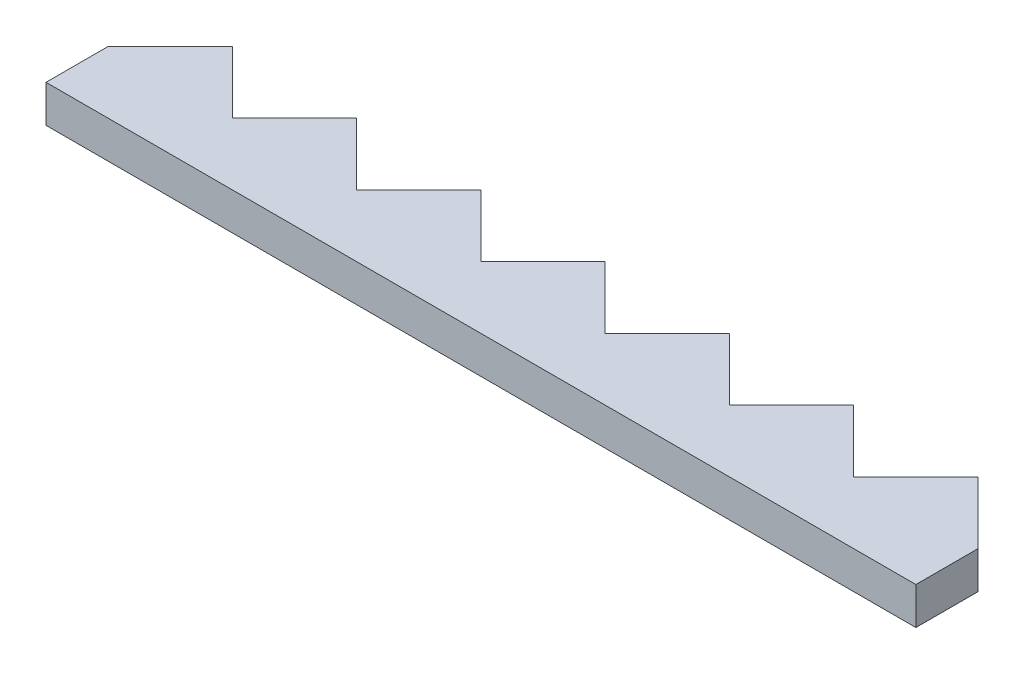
from build123d import *

# Parameters (mm, degrees)
BOSS_EXTRUDE1_DEPTH = 3


with BuildPart() as part:
    # Sketch1 → Boss-Extrude1 (new body)
    with BuildSketch(Plane(origin=(0, 0, 0), x_dir=(1, 0, 0), z_dir=(0, 1, 0))):
        Polygon((0, 5), (5, 10), (10, 5), (15, 10), (20, 5), (25, 10), (30, 5), (35, 10), (40, 5), (45, 10), (50, 5), (55, 10), (60, 5), (65, 10), (70, 5), (70, 0), (0, 0), align=None)
    extrude(amount=BOSS_EXTRUDE1_DEPTH)


solid = part.part
